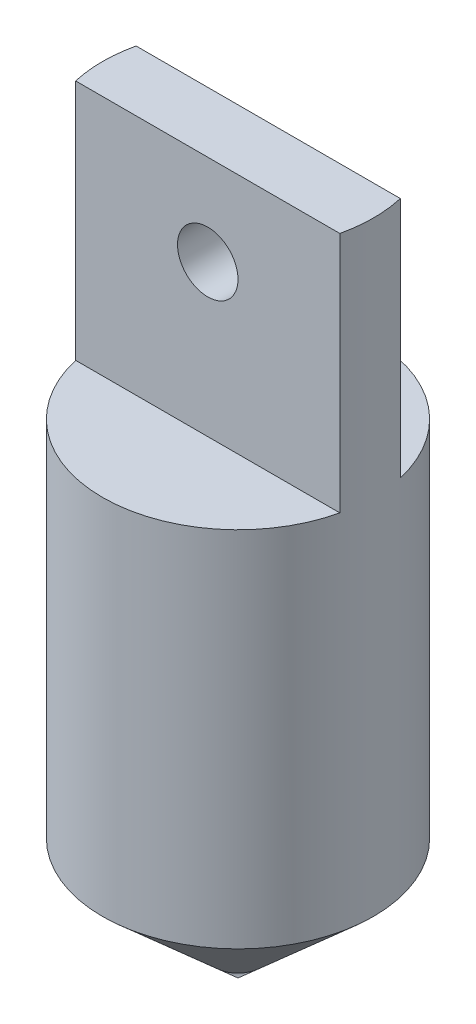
from build123d import *

# Parameters (mm, degrees)
CORTAR_EXTRUIR1_START = -5
CROQUIS2_W            = 44.800471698
CROQUIS2_H            = 40
CORTAR_EXTRUIR1_DEPTH = 63.849400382
CROQUIS3_R            = 5
CORTAR_EXTRUIR2_DEPTH = 70.660200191


with BuildPart() as part:
    # Croquis1 → Revoluci_n1 (revolve)
    with BuildSketch(Plane.XY, mode=Mode.PRIVATE) as revoluci_n1_sk:
        Polygon((0, -60), (22.400235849, -40), (22.400235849, 60), (0, 60), align=None)
    revolve(revoluci_n1_sk.sketch.rotate(Axis((0, 60, 0), (0, -1, 0)), 180), axis=Axis((0, 60, 0), (0, -1, 0)))

    # Croquis2 → Cortar-Extruir1 (cut, through all)
    with BuildSketch(Plane.XY.offset(CORTAR_EXTRUIR1_START)):
        with Locations((0, 40)):
            Rectangle(CROQUIS2_W, CROQUIS2_H)
    cortar_extruir1 = extrude(amount=-CORTAR_EXTRUIR1_DEPTH, mode=Mode.SUBTRACT)

    # Simetr_a1: Cortar-Extruir1 across plane
    add(cortar_extruir1.mirror(Plane.XY), mode=Mode.SUBTRACT)

    # Croquis3 → Cortar-Extruir2 (cut, through all)
    with BuildSketch(Plane.XY.offset(5)):
        with Locations((0, 45)):
            Circle(CROQUIS3_R)
    extrude(amount=-CORTAR_EXTRUIR2_DEPTH, mode=Mode.SUBTRACT)


solid = part.part
